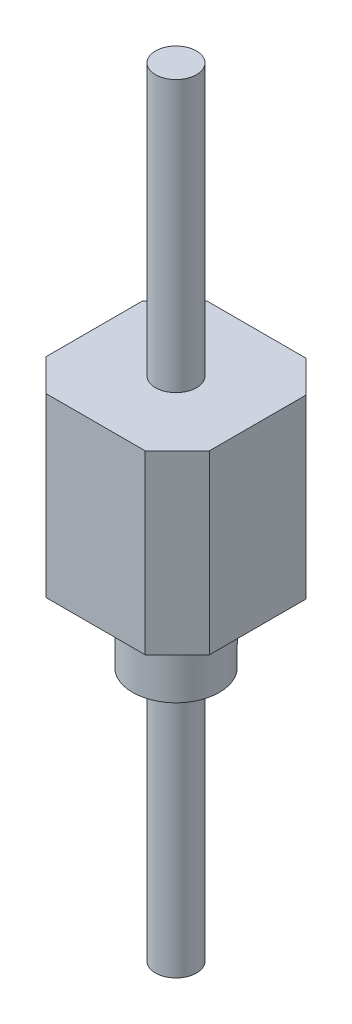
ISO-10303-21;
HEADER;
FILE_DESCRIPTION(('STEP AP214'),'2;1');
FILE_NAME('part.step','',(''),(''),'','','');
FILE_SCHEMA(('AUTOMOTIVE_DESIGN { 1 0 10303 214 1 1 1 1 }'));
ENDSEC;
DATA;
#1=APPLICATION_CONTEXT('core data for automotive mechanical design processes');
#2=APPLICATION_PROTOCOL_DEFINITION('international standard','automotive_design',2000,#1);
#3=PRODUCT_CONTEXT('',#1,'mechanical');
#4=PRODUCT('Part','Part','',(#3));
#5=PRODUCT_RELATED_PRODUCT_CATEGORY('part','',(#4));
#6=PRODUCT_DEFINITION_FORMATION('','',#4);
#7=PRODUCT_DEFINITION_CONTEXT('part definition',#1,'design');
#8=PRODUCT_DEFINITION('design','',#6,#7);
#9=PRODUCT_DEFINITION_SHAPE('','',#8);
#10=(LENGTH_UNIT() NAMED_UNIT(*) SI_UNIT(.MILLI.,.METRE.));
#11=(NAMED_UNIT(*) PLANE_ANGLE_UNIT() SI_UNIT($,.RADIAN.));
#12=(NAMED_UNIT(*) SI_UNIT($,.STERADIAN.) SOLID_ANGLE_UNIT());
#13=UNCERTAINTY_MEASURE_WITH_UNIT(LENGTH_MEASURE(1.E-05),#10,'distance_accuracy_value','');
#14=(GEOMETRIC_REPRESENTATION_CONTEXT(3) GLOBAL_UNCERTAINTY_ASSIGNED_CONTEXT((#13)) GLOBAL_UNIT_ASSIGNED_CONTEXT((#10,
#11,#12)) REPRESENTATION_CONTEXT('',''));
#15=CARTESIAN_POINT('',(0.,0.,0.));
#16=DIRECTION('',(0.,0.,1.));
#17=DIRECTION('',(1.,0.,0.));
#18=AXIS2_PLACEMENT_3D('',#15,#16,#17);
#19=CARTESIAN_POINT('',(0.,-1.18,0.));
#20=DIRECTION('',(0.,-1.,0.));
#21=DIRECTION('',(0.,0.,-1.));
#22=AXIS2_PLACEMENT_3D('',#19,#20,#21);
#23=PLANE('',#22);
#24=CARTESIAN_POINT('',(0.,-1.18,0.));
#25=DIRECTION('',(0.,-1.,0.));
#26=DIRECTION('',(0.,0.,-1.));
#27=AXIS2_PLACEMENT_3D('',#24,#25,#26);
#28=CIRCLE('',#27,0.675);
#29=CARTESIAN_POINT('',(0.,-1.18,-0.675));
#30=VERTEX_POINT('',#29);
#31=EDGE_CURVE('E188',#30,#30,#28,.T.);
#32=ORIENTED_EDGE('',*,*,#31,.T.);
#33=EDGE_LOOP('',(#32));
#34=FACE_BOUND('',#33,.T.);
#35=CARTESIAN_POINT('',(0.,-1.18,0.));
#36=DIRECTION('',(0.,-1.,0.));
#37=DIRECTION('',(0.,0.,-1.));
#38=AXIS2_PLACEMENT_3D('',#35,#36,#37);
#39=CIRCLE('',#38,0.32);
#40=CARTESIAN_POINT('',(0.,-1.18,-0.32));
#41=VERTEX_POINT('',#40);
#42=EDGE_CURVE('E194',#41,#41,#39,.T.);
#43=ORIENTED_EDGE('',*,*,#42,.F.);
#44=EDGE_LOOP('',(#43));
#45=FACE_BOUND('',#44,.T.);
#46=ADVANCED_FACE('F33',(#34,#45),#23,.T.);
#47=CARTESIAN_POINT('',(-1.27000000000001,0.,1.25));
#48=DIRECTION('',(0.,1.,0.));
#49=DIRECTION('',(0.,0.,1.));
#50=AXIS2_PLACEMENT_3D('',#47,#48,#49);
#51=PLANE('',#50);
#52=DIRECTION('',(0.,0.,1.));
#53=VECTOR('',#52,1.);
#54=CARTESIAN_POINT('',(-1.27,0.,-0.75));
#55=LINE('',#54,#53);
#56=CARTESIAN_POINT('',(-1.27,0.,-0.75));
#57=VERTEX_POINT('',#56);
#58=CARTESIAN_POINT('',(-1.27000000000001,0.,0.75));
#59=VERTEX_POINT('',#58);
#60=EDGE_CURVE('E132',#57,#59,#55,.T.);
#61=ORIENTED_EDGE('',*,*,#60,.F.);
#62=DIRECTION('',(-0.707106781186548,0.,0.707106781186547));
#63=VECTOR('',#62,1.);
#64=CARTESIAN_POINT('',(-1.27,0.,-0.75));
#65=LINE('',#64,#63);
#66=CARTESIAN_POINT('',(-0.77,0.,-1.25));
#67=VERTEX_POINT('',#66);
#68=EDGE_CURVE('E85',#67,#57,#65,.T.);
#69=ORIENTED_EDGE('',*,*,#68,.F.);
#70=DIRECTION('',(-1.,0.,0.));
#71=VECTOR('',#70,1.);
#72=CARTESIAN_POINT('',(-0.77,0.,-1.25));
#73=LINE('',#72,#71);
#74=CARTESIAN_POINT('',(0.77,0.,-1.24999999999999));
#75=VERTEX_POINT('',#74);
#76=EDGE_CURVE('E79',#75,#67,#73,.T.);
#77=ORIENTED_EDGE('',*,*,#76,.F.);
#78=DIRECTION('',(-0.707106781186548,0.,-0.707106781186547));
#79=VECTOR('',#78,1.);
#80=CARTESIAN_POINT('',(1.27,0.,-0.749999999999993));
#81=LINE('',#80,#79);
#82=CARTESIAN_POINT('',(1.27,0.,-0.749999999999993));
#83=VERTEX_POINT('',#82);
#84=EDGE_CURVE('E122',#83,#75,#81,.T.);
#85=ORIENTED_EDGE('',*,*,#84,.F.);
#86=DIRECTION('',(0.,0.,-1.));
#87=VECTOR('',#86,1.);
#88=CARTESIAN_POINT('',(1.26999999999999,0.,0.749999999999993));
#89=LINE('',#88,#87);
#90=CARTESIAN_POINT('',(1.26999999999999,0.,0.749999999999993));
#91=VERTEX_POINT('',#90);
#92=EDGE_CURVE('E142',#91,#83,#89,.T.);
#93=ORIENTED_EDGE('',*,*,#92,.F.);
#94=DIRECTION('',(0.707106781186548,0.,-0.707106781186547));
#95=VECTOR('',#94,1.);
#96=CARTESIAN_POINT('',(1.26999999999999,0.,0.749999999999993));
#97=LINE('',#96,#95);
#98=CARTESIAN_POINT('',(0.769999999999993,0.,1.24999999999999));
#99=VERTEX_POINT('',#98);
#100=EDGE_CURVE('E140',#99,#91,#97,.T.);
#101=ORIENTED_EDGE('',*,*,#100,.F.);
#102=DIRECTION('',(1.,0.,0.));
#103=VECTOR('',#102,1.);
#104=CARTESIAN_POINT('',(-0.770000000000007,0.,1.25));
#105=LINE('',#104,#103);
#106=CARTESIAN_POINT('',(-0.770000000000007,0.,1.25));
#107=VERTEX_POINT('',#106);
#108=EDGE_CURVE('E138',#107,#99,#105,.T.);
#109=ORIENTED_EDGE('',*,*,#108,.F.);
#110=DIRECTION('',(0.707106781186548,0.,0.707106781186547));
#111=VECTOR('',#110,1.);
#112=CARTESIAN_POINT('',(-1.27000000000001,0.,0.75));
#113=LINE('',#112,#111);
#114=EDGE_CURVE('E135',#59,#107,#113,.T.);
#115=ORIENTED_EDGE('',*,*,#114,.F.);
#116=EDGE_LOOP('',(#61,#69,#77,#85,#93,#101,#109,#115));
#117=FACE_BOUND('',#116,.T.);
#118=CARTESIAN_POINT('',(0.,0.,0.));
#119=DIRECTION('',(0.,1.,0.));
#120=DIRECTION('',(0.,0.,1.));
#121=AXIS2_PLACEMENT_3D('',#118,#119,#120);
#122=CIRCLE('',#121,0.675);
#123=CARTESIAN_POINT('',(0.,0.,0.675));
#124=VERTEX_POINT('',#123);
#125=EDGE_CURVE('E11',#124,#124,#122,.F.);
#126=ORIENTED_EDGE('',*,*,#125,.F.);
#127=EDGE_LOOP('',(#126));
#128=FACE_BOUND('',#127,.T.);
#129=ADVANCED_FACE('F165',(#117,#128),#51,.F.);
#130=CARTESIAN_POINT('',(-1.27000000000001,2.75,1.25));
#131=DIRECTION('',(0.,1.,0.));
#132=DIRECTION('',(0.,0.,1.));
#133=AXIS2_PLACEMENT_3D('',#130,#131,#132);
#134=PLANE('',#133);
#135=DIRECTION('',(0.,0.,1.));
#136=VECTOR('',#135,1.);
#137=CARTESIAN_POINT('',(-1.27,2.75,-0.75));
#138=LINE('',#137,#136);
#139=CARTESIAN_POINT('',(-1.27,2.75,-0.75));
#140=VERTEX_POINT('',#139);
#141=CARTESIAN_POINT('',(-1.27000000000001,2.75,0.75));
#142=VERTEX_POINT('',#141);
#143=EDGE_CURVE('E147',#140,#142,#138,.T.);
#144=ORIENTED_EDGE('',*,*,#143,.T.);
#145=DIRECTION('',(0.707106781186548,0.,0.707106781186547));
#146=VECTOR('',#145,1.);
#147=CARTESIAN_POINT('',(-1.27000000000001,2.75,0.75));
#148=LINE('',#147,#146);
#149=CARTESIAN_POINT('',(-0.770000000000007,2.75,1.25));
#150=VERTEX_POINT('',#149);
#151=EDGE_CURVE('E94',#142,#150,#148,.T.);
#152=ORIENTED_EDGE('',*,*,#151,.T.);
#153=DIRECTION('',(1.,0.,0.));
#154=VECTOR('',#153,1.);
#155=CARTESIAN_POINT('',(-0.770000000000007,2.75,1.25));
#156=LINE('',#155,#154);
#157=CARTESIAN_POINT('',(0.769999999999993,2.75,1.24999999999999));
#158=VERTEX_POINT('',#157);
#159=EDGE_CURVE('E179',#150,#158,#156,.T.);
#160=ORIENTED_EDGE('',*,*,#159,.T.);
#161=DIRECTION('',(0.707106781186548,0.,-0.707106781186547));
#162=VECTOR('',#161,1.);
#163=CARTESIAN_POINT('',(1.26999999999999,2.75,0.749999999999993));
#164=LINE('',#163,#162);
#165=CARTESIAN_POINT('',(1.26999999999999,2.75,0.749999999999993));
#166=VERTEX_POINT('',#165);
#167=EDGE_CURVE('E178',#158,#166,#164,.T.);
#168=ORIENTED_EDGE('',*,*,#167,.T.);
#169=DIRECTION('',(0.,0.,-1.));
#170=VECTOR('',#169,1.);
#171=CARTESIAN_POINT('',(1.26999999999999,2.75,0.749999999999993));
#172=LINE('',#171,#170);
#173=CARTESIAN_POINT('',(1.27,2.75,-0.749999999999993));
#174=VERTEX_POINT('',#173);
#175=EDGE_CURVE('E114',#166,#174,#172,.T.);
#176=ORIENTED_EDGE('',*,*,#175,.T.);
#177=DIRECTION('',(-0.707106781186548,0.,-0.707106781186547));
#178=VECTOR('',#177,1.);
#179=CARTESIAN_POINT('',(1.27,2.75,-0.749999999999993));
#180=LINE('',#179,#178);
#181=CARTESIAN_POINT('',(0.77,2.75,-1.24999999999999));
#182=VERTEX_POINT('',#181);
#183=EDGE_CURVE('E107',#174,#182,#180,.T.);
#184=ORIENTED_EDGE('',*,*,#183,.T.);
#185=DIRECTION('',(-1.,0.,0.));
#186=VECTOR('',#185,1.);
#187=CARTESIAN_POINT('',(-0.77,2.75,-1.25));
#188=LINE('',#187,#186);
#189=CARTESIAN_POINT('',(-0.77,2.75,-1.25));
#190=VERTEX_POINT('',#189);
#191=EDGE_CURVE('E112',#182,#190,#188,.T.);
#192=ORIENTED_EDGE('',*,*,#191,.T.);
#193=DIRECTION('',(-0.707106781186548,0.,0.707106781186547));
#194=VECTOR('',#193,1.);
#195=CARTESIAN_POINT('',(-1.27,2.75,-0.75));
#196=LINE('',#195,#194);
#197=EDGE_CURVE('E50',#190,#140,#196,.T.);
#198=ORIENTED_EDGE('',*,*,#197,.T.);
#199=EDGE_LOOP('',(#144,#152,#160,#168,#176,#184,#192,#198));
#200=FACE_BOUND('',#199,.T.);
#201=CARTESIAN_POINT('',(0.,2.75,0.));
#202=DIRECTION('',(0.,1.,0.));
#203=DIRECTION('',(0.,0.,1.));
#204=AXIS2_PLACEMENT_3D('',#201,#202,#203);
#205=CIRCLE('',#204,0.32);
#206=CARTESIAN_POINT('',(0.,2.75,0.32));
#207=VERTEX_POINT('',#206);
#208=EDGE_CURVE('E185',#207,#207,#205,.T.);
#209=ORIENTED_EDGE('',*,*,#208,.F.);
#210=EDGE_LOOP('',(#209));
#211=FACE_BOUND('',#210,.T.);
#212=ADVANCED_FACE('F109',(#200,#211),#134,.T.);
#213=CARTESIAN_POINT('',(-1.27,2.75,-0.75));
#214=DIRECTION('',(1.,0.,0.));
#215=DIRECTION('',(0.,0.,-1.));
#216=AXIS2_PLACEMENT_3D('',#213,#214,#215);
#217=PLANE('',#216);
#218=ORIENTED_EDGE('',*,*,#60,.T.);
#219=DIRECTION('',(0.,-1.,0.));
#220=VECTOR('',#219,1.);
#221=CARTESIAN_POINT('',(-1.27000000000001,2.75,0.75));
#222=LINE('',#221,#220);
#223=EDGE_CURVE('E42',#142,#59,#222,.T.);
#224=ORIENTED_EDGE('',*,*,#223,.F.);
#225=ORIENTED_EDGE('',*,*,#143,.F.);
#226=DIRECTION('',(0.,-1.,0.));
#227=VECTOR('',#226,1.);
#228=CARTESIAN_POINT('',(-1.27,2.75,-0.75));
#229=LINE('',#228,#227);
#230=EDGE_CURVE('E128',#140,#57,#229,.T.);
#231=ORIENTED_EDGE('',*,*,#230,.T.);
#232=EDGE_LOOP('',(#218,#224,#225,#231));
#233=FACE_BOUND('',#232,.T.);
#234=ADVANCED_FACE('F35',(#233),#217,.F.);
#235=CARTESIAN_POINT('',(-1.27000000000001,2.75,0.75));
#236=DIRECTION('',(0.707106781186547,0.,-0.707106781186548));
#237=DIRECTION('',(-0.707106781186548,0.,-0.707106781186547));
#238=AXIS2_PLACEMENT_3D('',#235,#236,#237);
#239=PLANE('',#238);
#240=ORIENTED_EDGE('',*,*,#114,.T.);
#241=DIRECTION('',(0.,-1.,0.));
#242=VECTOR('',#241,1.);
#243=CARTESIAN_POINT('',(-0.770000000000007,2.75,1.25));
#244=LINE('',#243,#242);
#245=EDGE_CURVE('E157',#150,#107,#244,.T.);
#246=ORIENTED_EDGE('',*,*,#245,.F.);
#247=ORIENTED_EDGE('',*,*,#151,.F.);
#248=ORIENTED_EDGE('',*,*,#223,.T.);
#249=EDGE_LOOP('',(#240,#246,#247,#248));
#250=FACE_BOUND('',#249,.T.);
#251=ADVANCED_FACE('F160',(#250),#239,.F.);
#252=CARTESIAN_POINT('',(-0.770000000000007,2.75,1.25));
#253=DIRECTION('',(0.,0.,-1.));
#254=DIRECTION('',(-1.,0.,0.));
#255=AXIS2_PLACEMENT_3D('',#252,#253,#254);
#256=PLANE('',#255);
#257=ORIENTED_EDGE('',*,*,#108,.T.);
#258=DIRECTION('',(0.,-1.,0.));
#259=VECTOR('',#258,1.);
#260=CARTESIAN_POINT('',(0.769999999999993,2.75,1.24999999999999));
#261=LINE('',#260,#259);
#262=EDGE_CURVE('E154',#158,#99,#261,.T.);
#263=ORIENTED_EDGE('',*,*,#262,.F.);
#264=ORIENTED_EDGE('',*,*,#159,.F.);
#265=ORIENTED_EDGE('',*,*,#245,.T.);
#266=EDGE_LOOP('',(#257,#263,#264,#265));
#267=FACE_BOUND('',#266,.T.);
#268=ADVANCED_FACE('F172',(#267),#256,.F.);
#269=CARTESIAN_POINT('',(1.26999999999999,2.75,0.749999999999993));
#270=DIRECTION('',(-0.707106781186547,0.,-0.707106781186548));
#271=DIRECTION('',(-0.707106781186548,0.,0.707106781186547));
#272=AXIS2_PLACEMENT_3D('',#269,#270,#271);
#273=PLANE('',#272);
#274=ORIENTED_EDGE('',*,*,#100,.T.);
#275=DIRECTION('',(0.,-1.,0.));
#276=VECTOR('',#275,1.);
#277=CARTESIAN_POINT('',(1.26999999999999,2.75,0.749999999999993));
#278=LINE('',#277,#276);
#279=EDGE_CURVE('E151',#166,#91,#278,.T.);
#280=ORIENTED_EDGE('',*,*,#279,.F.);
#281=ORIENTED_EDGE('',*,*,#167,.F.);
#282=ORIENTED_EDGE('',*,*,#262,.T.);
#283=EDGE_LOOP('',(#274,#280,#281,#282));
#284=FACE_BOUND('',#283,.T.);
#285=ADVANCED_FACE('F176',(#284),#273,.F.);
#286=CARTESIAN_POINT('',(1.26999999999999,2.75,0.749999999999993));
#287=DIRECTION('',(-1.,0.,0.));
#288=DIRECTION('',(0.,0.,1.));
#289=AXIS2_PLACEMENT_3D('',#286,#287,#288);
#290=PLANE('',#289);
#291=ORIENTED_EDGE('',*,*,#92,.T.);
#292=DIRECTION('',(0.,-1.,0.));
#293=VECTOR('',#292,1.);
#294=CARTESIAN_POINT('',(1.27,2.75,-0.749999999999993));
#295=LINE('',#294,#293);
#296=EDGE_CURVE('E123',#174,#83,#295,.T.);
#297=ORIENTED_EDGE('',*,*,#296,.F.);
#298=ORIENTED_EDGE('',*,*,#175,.F.);
#299=ORIENTED_EDGE('',*,*,#279,.T.);
#300=EDGE_LOOP('',(#291,#297,#298,#299));
#301=FACE_BOUND('',#300,.T.);
#302=ADVANCED_FACE('F238',(#301),#290,.F.);
#303=CARTESIAN_POINT('',(1.27,2.75,-0.749999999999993));
#304=DIRECTION('',(-0.707106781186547,0.,0.707106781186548));
#305=DIRECTION('',(0.707106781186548,0.,0.707106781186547));
#306=AXIS2_PLACEMENT_3D('',#303,#304,#305);
#307=PLANE('',#306);
#308=ORIENTED_EDGE('',*,*,#84,.T.);
#309=DIRECTION('',(0.,-1.,0.));
#310=VECTOR('',#309,1.);
#311=CARTESIAN_POINT('',(0.77,2.75,-1.24999999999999));
#312=LINE('',#311,#310);
#313=EDGE_CURVE('E119',#182,#75,#312,.T.);
#314=ORIENTED_EDGE('',*,*,#313,.F.);
#315=ORIENTED_EDGE('',*,*,#183,.F.);
#316=ORIENTED_EDGE('',*,*,#296,.T.);
#317=EDGE_LOOP('',(#308,#314,#315,#316));
#318=FACE_BOUND('',#317,.T.);
#319=ADVANCED_FACE('F120',(#318),#307,.F.);
#320=CARTESIAN_POINT('',(-0.77,2.75,-1.25));
#321=DIRECTION('',(0.,0.,1.));
#322=DIRECTION('',(1.,0.,0.));
#323=AXIS2_PLACEMENT_3D('',#320,#321,#322);
#324=PLANE('',#323);
#325=ORIENTED_EDGE('',*,*,#76,.T.);
#326=DIRECTION('',(0.,-1.,0.));
#327=VECTOR('',#326,1.);
#328=CARTESIAN_POINT('',(-0.77,2.75,-1.25));
#329=LINE('',#328,#327);
#330=EDGE_CURVE('E124',#190,#67,#329,.T.);
#331=ORIENTED_EDGE('',*,*,#330,.F.);
#332=ORIENTED_EDGE('',*,*,#191,.F.);
#333=ORIENTED_EDGE('',*,*,#313,.T.);
#334=EDGE_LOOP('',(#325,#331,#332,#333));
#335=FACE_BOUND('',#334,.T.);
#336=ADVANCED_FACE('F126',(#335),#324,.F.);
#337=CARTESIAN_POINT('',(-1.27,2.75,-0.75));
#338=DIRECTION('',(0.707106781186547,0.,0.707106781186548));
#339=DIRECTION('',(0.707106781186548,0.,-0.707106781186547));
#340=AXIS2_PLACEMENT_3D('',#337,#338,#339);
#341=PLANE('',#340);
#342=ORIENTED_EDGE('',*,*,#68,.T.);
#343=ORIENTED_EDGE('',*,*,#230,.F.);
#344=ORIENTED_EDGE('',*,*,#197,.F.);
#345=ORIENTED_EDGE('',*,*,#330,.T.);
#346=EDGE_LOOP('',(#342,#343,#344,#345));
#347=FACE_BOUND('',#346,.T.);
#348=ADVANCED_FACE('F228',(#347),#341,.F.);
#349=CARTESIAN_POINT('',(0.,6.97,0.));
#350=DIRECTION('',(0.,-1.,0.));
#351=DIRECTION('',(0.,0.,-1.));
#352=AXIS2_PLACEMENT_3D('',#349,#350,#351);
#353=CYLINDRICAL_SURFACE('',#352,0.32);
#354=CARTESIAN_POINT('',(0.,6.97,0.));
#355=DIRECTION('',(0.,1.,0.));
#356=DIRECTION('',(0.,0.,1.));
#357=AXIS2_PLACEMENT_3D('',#354,#355,#356);
#358=CIRCLE('',#357,0.32);
#359=CARTESIAN_POINT('',(0.,6.97,0.32));
#360=VERTEX_POINT('',#359);
#361=EDGE_CURVE('E136',#360,#360,#358,.T.);
#362=ORIENTED_EDGE('',*,*,#361,.F.);
#363=EDGE_LOOP('',(#362));
#364=FACE_BOUND('',#363,.T.);
#365=ORIENTED_EDGE('',*,*,#208,.T.);
#366=EDGE_LOOP('',(#365));
#367=FACE_BOUND('',#366,.T.);
#368=ADVANCED_FACE('F224',(#364,#367),#353,.T.);
#369=CARTESIAN_POINT('',(0.,6.97,0.));
#370=DIRECTION('',(0.,1.,0.));
#371=DIRECTION('',(0.,0.,1.));
#372=AXIS2_PLACEMENT_3D('',#369,#370,#371);
#373=PLANE('',#372);
#374=ORIENTED_EDGE('',*,*,#361,.T.);
#375=EDGE_LOOP('',(#374));
#376=FACE_BOUND('',#375,.T.);
#377=ADVANCED_FACE('F220',(#376),#373,.T.);
#378=CARTESIAN_POINT('',(0.,-1.18,0.));
#379=DIRECTION('',(0.,1.,0.));
#380=DIRECTION('',(0.,0.,1.));
#381=AXIS2_PLACEMENT_3D('',#378,#379,#380);
#382=CYLINDRICAL_SURFACE('',#381,0.675);
#383=ORIENTED_EDGE('',*,*,#31,.F.);
#384=EDGE_LOOP('',(#383));
#385=FACE_BOUND('',#384,.T.);
#386=ORIENTED_EDGE('',*,*,#125,.T.);
#387=EDGE_LOOP('',(#386));
#388=FACE_BOUND('',#387,.T.);
#389=ADVANCED_FACE('F205',(#385,#388),#382,.T.);
#390=CARTESIAN_POINT('',(0.,-5.14,0.));
#391=DIRECTION('',(0.,1.,0.));
#392=DIRECTION('',(0.,0.,1.));
#393=AXIS2_PLACEMENT_3D('',#390,#391,#392);
#394=CYLINDRICAL_SURFACE('',#393,0.32);
#395=CARTESIAN_POINT('',(0.,-5.14,0.));
#396=DIRECTION('',(0.,-1.,0.));
#397=DIRECTION('',(0.,0.,-1.));
#398=AXIS2_PLACEMENT_3D('',#395,#396,#397);
#399=CIRCLE('',#398,0.32);
#400=CARTESIAN_POINT('',(0.,-5.14,-0.32));
#401=VERTEX_POINT('',#400);
#402=EDGE_CURVE('E193',#401,#401,#399,.T.);
#403=ORIENTED_EDGE('',*,*,#402,.F.);
#404=EDGE_LOOP('',(#403));
#405=FACE_BOUND('',#404,.T.);
#406=ORIENTED_EDGE('',*,*,#42,.T.);
#407=EDGE_LOOP('',(#406));
#408=FACE_BOUND('',#407,.T.);
#409=ADVANCED_FACE('F202',(#405,#408),#394,.T.);
#410=CARTESIAN_POINT('',(0.,-5.14,0.));
#411=DIRECTION('',(0.,-1.,0.));
#412=DIRECTION('',(0.,0.,-1.));
#413=AXIS2_PLACEMENT_3D('',#410,#411,#412);
#414=PLANE('',#413);
#415=ORIENTED_EDGE('',*,*,#402,.T.);
#416=EDGE_LOOP('',(#415));
#417=FACE_BOUND('',#416,.T.);
#418=ADVANCED_FACE('F200',(#417),#414,.T.);
#419=CLOSED_SHELL('',(#46,#129,#212,#234,#251,#268,#285,#302,#319,#336,#348,#368,#377,#389,#409,#418));
#420=MANIFOLD_SOLID_BREP('B2',#419);
#421=ADVANCED_BREP_SHAPE_REPRESENTATION('',(#18,#420),#14);
#422=SHAPE_DEFINITION_REPRESENTATION(#9,#421);
ENDSEC;
END-ISO-10303-21;
